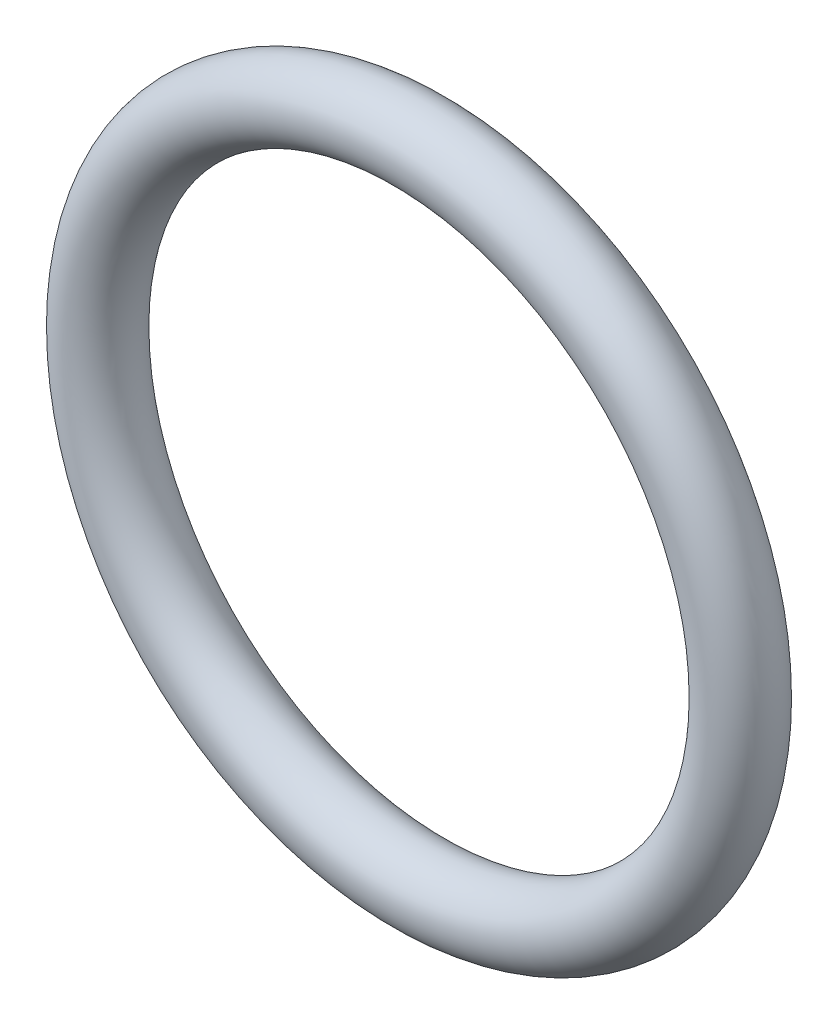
ISO-10303-21;
HEADER;
FILE_DESCRIPTION(('STEP AP214'),'2;1');
FILE_NAME('part.step','',(''),(''),'','','');
FILE_SCHEMA(('AUTOMOTIVE_DESIGN { 1 0 10303 214 1 1 1 1 }'));
ENDSEC;
DATA;
#1=APPLICATION_CONTEXT('core data for automotive mechanical design processes');
#2=APPLICATION_PROTOCOL_DEFINITION('international standard','automotive_design',2000,#1);
#3=PRODUCT_CONTEXT('',#1,'mechanical');
#4=PRODUCT('Part','Part','',(#3));
#5=PRODUCT_RELATED_PRODUCT_CATEGORY('part','',(#4));
#6=PRODUCT_DEFINITION_FORMATION('','',#4);
#7=PRODUCT_DEFINITION_CONTEXT('part definition',#1,'design');
#8=PRODUCT_DEFINITION('design','',#6,#7);
#9=PRODUCT_DEFINITION_SHAPE('','',#8);
#10=(LENGTH_UNIT() NAMED_UNIT(*) SI_UNIT(.MILLI.,.METRE.));
#11=(NAMED_UNIT(*) PLANE_ANGLE_UNIT() SI_UNIT($,.RADIAN.));
#12=(NAMED_UNIT(*) SI_UNIT($,.STERADIAN.) SOLID_ANGLE_UNIT());
#13=UNCERTAINTY_MEASURE_WITH_UNIT(LENGTH_MEASURE(1.E-05),#10,'distance_accuracy_value','');
#14=(GEOMETRIC_REPRESENTATION_CONTEXT(3) GLOBAL_UNCERTAINTY_ASSIGNED_CONTEXT((#13)) GLOBAL_UNIT_ASSIGNED_CONTEXT((#10,
#11,#12)) REPRESENTATION_CONTEXT('',''));
#15=CARTESIAN_POINT('',(0.,0.,0.));
#16=DIRECTION('',(0.,0.,1.));
#17=DIRECTION('',(1.,0.,0.));
#18=AXIS2_PLACEMENT_3D('',#15,#16,#17);
#19=CARTESIAN_POINT('',(0.,0.,0.));
#20=DIRECTION('',(0.,0.,-1.));
#21=DIRECTION('',(-1.,0.,0.));
#22=AXIS2_PLACEMENT_3D('',#19,#20,#21);
#23=TOROIDAL_SURFACE('',#22,7.8867,0.889);
#24=ADVANCED_FACE('F13',(),#23,.T.);
#25=CLOSED_SHELL('',(#24));
#26=MANIFOLD_SOLID_BREP('B1',#25);
#27=ADVANCED_BREP_SHAPE_REPRESENTATION('',(#18,#26),#14);
#28=SHAPE_DEFINITION_REPRESENTATION(#9,#27);
ENDSEC;
END-ISO-10303-21;
